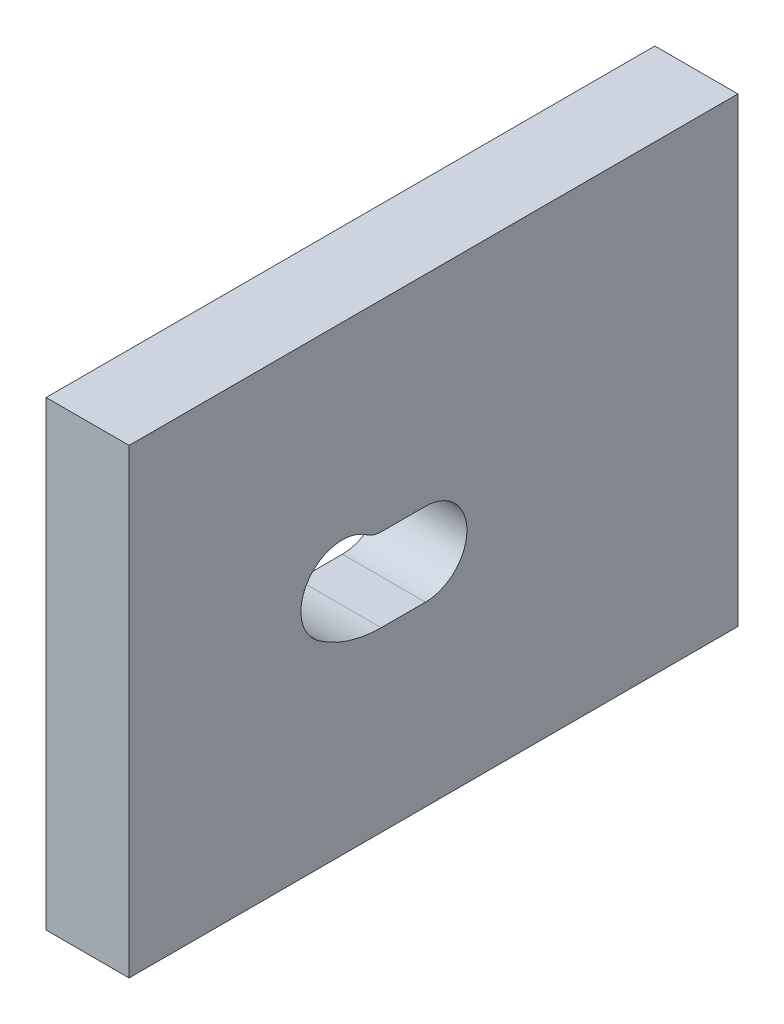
from build123d import *

# Parameters (mm, degrees)
SKETCH1_W      = 146.672646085
SKETCH1_H      = 111.127345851
EXTRUDE1_DEPTH = 20


with BuildPart() as part:
    # Sketch1 → Extrude1 (new body)
    with BuildSketch(Plane(origin=(0, 0, 0), x_dir=(0, 0, -1), z_dir=(1, 0, 0))):
        with Locations((12.614494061, 2.836685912)):
            Rectangle(SKETCH1_W, SKETCH1_H)
        with BuildLine():
            Line((10.672620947, 10), (0, 10))
            ThreePointArc((0, 10), (-1.837117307, 10.288170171), (-3.497767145, 11.125))
            ThreePointArc((-3.497767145, 11.125), (-17.452379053, 8.829611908), (-15.156990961, -5.125))
            ThreePointArc((-15.156990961, -5.125), (-7.960841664, -8.751262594), (0, -10))
            Line((0, -10), (10.672620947, -10))
            ThreePointArc((10.672620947, -10), (20.672620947, 0), (10.672620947, 10))
        make_face(mode=Mode.SUBTRACT)
    extrude(amount=EXTRUDE1_DEPTH)


solid = part.part
